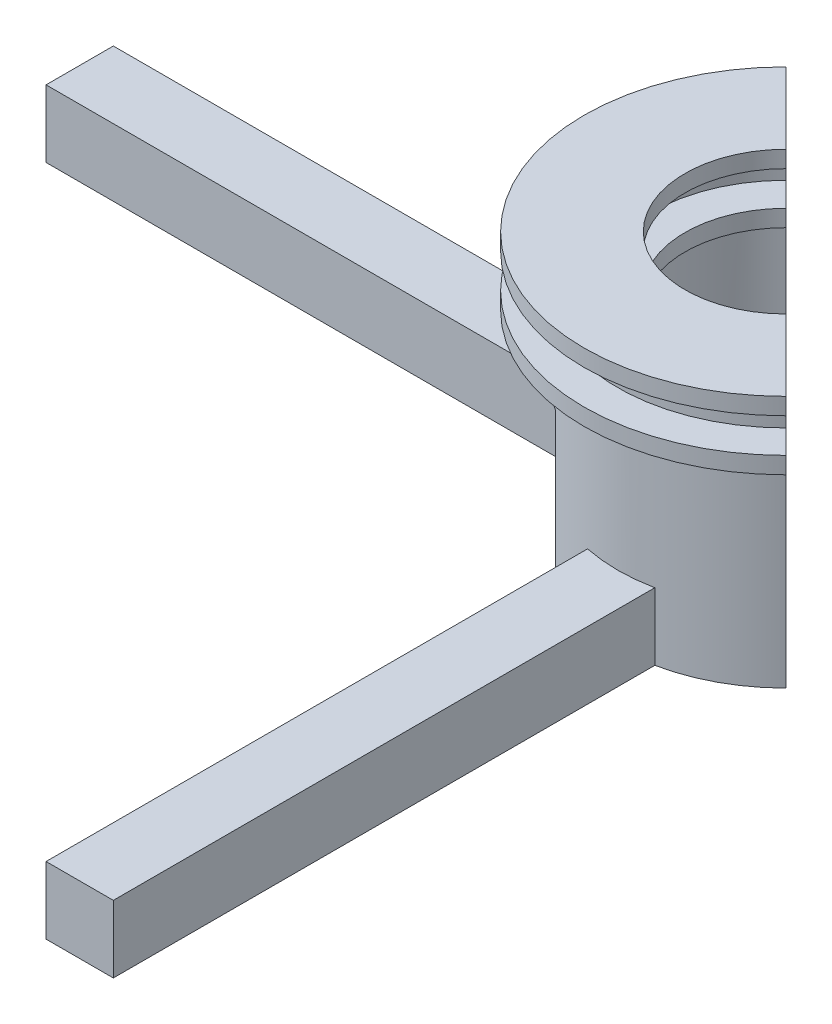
ISO-10303-21;
HEADER;
FILE_DESCRIPTION(('STEP AP214'),'2;1');
FILE_NAME('part.step','',(''),(''),'','','');
FILE_SCHEMA(('AUTOMOTIVE_DESIGN { 1 0 10303 214 1 1 1 1 }'));
ENDSEC;
DATA;
#1=APPLICATION_CONTEXT('core data for automotive mechanical design processes');
#2=APPLICATION_PROTOCOL_DEFINITION('international standard','automotive_design',2000,#1);
#3=PRODUCT_CONTEXT('',#1,'mechanical');
#4=PRODUCT('Part','Part','',(#3));
#5=PRODUCT_RELATED_PRODUCT_CATEGORY('part','',(#4));
#6=PRODUCT_DEFINITION_FORMATION('','',#4);
#7=PRODUCT_DEFINITION_CONTEXT('part definition',#1,'design');
#8=PRODUCT_DEFINITION('design','',#6,#7);
#9=PRODUCT_DEFINITION_SHAPE('','',#8);
#10=(LENGTH_UNIT() NAMED_UNIT(*) SI_UNIT(.MILLI.,.METRE.));
#11=(NAMED_UNIT(*) PLANE_ANGLE_UNIT() SI_UNIT($,.RADIAN.));
#12=(NAMED_UNIT(*) SI_UNIT($,.STERADIAN.) SOLID_ANGLE_UNIT());
#13=UNCERTAINTY_MEASURE_WITH_UNIT(LENGTH_MEASURE(1.E-05),#10,'distance_accuracy_value','');
#14=(GEOMETRIC_REPRESENTATION_CONTEXT(3) GLOBAL_UNCERTAINTY_ASSIGNED_CONTEXT((#13)) GLOBAL_UNIT_ASSIGNED_CONTEXT((#10,
#11,#12)) REPRESENTATION_CONTEXT('',''));
#15=CARTESIAN_POINT('',(0.,0.,0.));
#16=DIRECTION('',(0.,0.,1.));
#17=DIRECTION('',(1.,0.,0.));
#18=AXIS2_PLACEMENT_3D('',#15,#16,#17);
#19=CARTESIAN_POINT('',(0.,-41.1,0.));
#20=DIRECTION('',(0.,1.,0.));
#21=DIRECTION('',(0.,0.,1.));
#22=AXIS2_PLACEMENT_3D('',#19,#20,#21);
#23=PLANE('',#22);
#24=CARTESIAN_POINT('',(0.,-41.1,0.));
#25=DIRECTION('',(0.,1.,0.));
#26=DIRECTION('',(0.,0.,1.));
#27=AXIS2_PLACEMENT_3D('',#24,#25,#26);
#28=CIRCLE('',#27,25.);
#29=CARTESIAN_POINT('',(-17.6776695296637,-41.1,-17.6776695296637));
#30=VERTEX_POINT('',#29);
#31=CARTESIAN_POINT('',(-24.4948974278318,-41.1,-4.99999999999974));
#32=VERTEX_POINT('',#31);
#33=EDGE_CURVE('E276',#30,#32,#28,.T.);
#34=ORIENTED_EDGE('',*,*,#33,.F.);
#35=DIRECTION('',(0.707106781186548,0.,0.707106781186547));
#36=VECTOR('',#35,1.);
#37=CARTESIAN_POINT('',(0.,-41.1,0.));
#38=LINE('',#37,#36);
#39=CARTESIAN_POINT('',(-4.34870670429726,-41.1,-4.34870670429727));
#40=VERTEX_POINT('',#39);
#41=EDGE_CURVE('E265',#30,#40,#38,.T.);
#42=ORIENTED_EDGE('',*,*,#41,.T.);
#43=DIRECTION('',(0.707106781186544,0.,-0.707106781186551));
#44=VECTOR('',#43,1.);
#45=CARTESIAN_POINT('',(-17.8056287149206,-41.1,9.1082153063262));
#46=LINE('',#45,#44);
#47=CARTESIAN_POINT('',(-9.65200756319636,-41.1,0.95459415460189));
#48=VERTEX_POINT('',#47);
#49=EDGE_CURVE('E273',#48,#40,#46,.T.);
#50=ORIENTED_EDGE('',*,*,#49,.F.);
#51=DIRECTION('',(0.707106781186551,0.,0.707106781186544));
#52=VECTOR('',#51,1.);
#53=CARTESIAN_POINT('',(-20.050749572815,-41.1,-9.44414785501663));
#54=LINE('',#53,#52);
#55=CARTESIAN_POINT('',(-18.413411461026,-41.1,-7.80680974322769));
#56=VERTEX_POINT('',#55);
#57=EDGE_CURVE('E305',#56,#48,#54,.T.);
#58=ORIENTED_EDGE('',*,*,#57,.F.);
#59=CARTESIAN_POINT('',(0.,-41.1,0.));
#60=DIRECTION('',(0.,1.,0.));
#61=DIRECTION('',(0.,0.,1.));
#62=AXIS2_PLACEMENT_3D('',#59,#60,#61);
#63=CIRCLE('',#62,20.);
#64=CARTESIAN_POINT('',(-17.8056287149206,-41.1,9.1082153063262));
#65=VERTEX_POINT('',#64);
#66=EDGE_CURVE('E477',#56,#65,#63,.T.);
#67=ORIENTED_EDGE('',*,*,#66,.T.);
#68=DIRECTION('',(-0.707106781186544,0.,0.707106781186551));
#69=VECTOR('',#68,1.);
#70=CARTESIAN_POINT('',(100.651293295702,-41.1,-109.348706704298));
#71=LINE('',#70,#69);
#72=CARTESIAN_POINT('',(-21.4831384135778,-41.1,12.7857250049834));
#73=VERTEX_POINT('',#72);
#74=EDGE_CURVE('E309',#65,#73,#71,.T.);
#75=ORIENTED_EDGE('',*,*,#74,.T.);
#76=CARTESIAN_POINT('',(-24.4948974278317,-41.1,5.00000000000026));
#77=VERTEX_POINT('',#76);
#78=EDGE_CURVE('E417',#77,#73,#28,.T.);
#79=ORIENTED_EDGE('',*,*,#78,.F.);
#80=DIRECTION('',(1.,0.,0.));
#81=VECTOR('',#80,1.);
#82=CARTESIAN_POINT('',(-105.,-41.1,5.0000000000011));
#83=LINE('',#82,#81);
#84=CARTESIAN_POINT('',(-105.,-41.1,5.0000000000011));
#85=VERTEX_POINT('',#84);
#86=EDGE_CURVE('E367',#85,#77,#83,.T.);
#87=ORIENTED_EDGE('',*,*,#86,.F.);
#88=DIRECTION('',(0.,0.,1.));
#89=VECTOR('',#88,1.);
#90=CARTESIAN_POINT('',(-105.,-41.1,5.0000000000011));
#91=LINE('',#90,#89);
#92=CARTESIAN_POINT('',(-105.,-41.1,-4.9999999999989));
#93=VERTEX_POINT('',#92);
#94=EDGE_CURVE('E339',#93,#85,#91,.T.);
#95=ORIENTED_EDGE('',*,*,#94,.F.);
#96=DIRECTION('',(1.,0.,0.));
#97=VECTOR('',#96,1.);
#98=CARTESIAN_POINT('',(-105.,-41.1,-4.9999999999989));
#99=LINE('',#98,#97);
#100=EDGE_CURVE('E356',#93,#32,#99,.T.);
#101=ORIENTED_EDGE('',*,*,#100,.T.);
#102=EDGE_LOOP('',(#34,#42,#50,#58,#67,#75,#79,#87,#95,#101));
#103=FACE_BOUND('',#102,.T.);
#104=ADVANCED_FACE('F45',(#103),#23,.F.);
#105=CARTESIAN_POINT('',(-20.050749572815,-26.1,-9.44414785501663));
#106=DIRECTION('',(0.,-1.,0.));
#107=DIRECTION('',(0.,0.,-1.));
#108=AXIS2_PLACEMENT_3D('',#105,#106,#107);
#109=PLANE('',#108);
#110=DIRECTION('',(0.707106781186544,0.,-0.707106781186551));
#111=VECTOR('',#110,1.);
#112=CARTESIAN_POINT('',(-9.65200756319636,-26.1,0.95459415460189));
#113=LINE('',#112,#111);
#114=CARTESIAN_POINT('',(-9.65200756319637,-26.1,0.954594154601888));
#115=VERTEX_POINT('',#114);
#116=CARTESIAN_POINT('',(-4.34870670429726,-26.1,-4.34870670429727));
#117=VERTEX_POINT('',#116);
#118=EDGE_CURVE('E296',#115,#117,#113,.T.);
#119=ORIENTED_EDGE('',*,*,#118,.T.);
#120=DIRECTION('',(-0.707106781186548,0.,-0.707106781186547));
#121=VECTOR('',#120,1.);
#122=CARTESIAN_POINT('',(-14.7474487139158,-26.1,-14.7474487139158));
#123=LINE('',#122,#121);
#124=CARTESIAN_POINT('',(-14.142135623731,-26.1,-14.142135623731));
#125=VERTEX_POINT('',#124);
#126=EDGE_CURVE('E69',#117,#125,#123,.T.);
#127=ORIENTED_EDGE('',*,*,#126,.T.);
#128=CARTESIAN_POINT('',(0.,-26.1,0.));
#129=DIRECTION('',(0.,-1.,0.));
#130=DIRECTION('',(0.,0.,-1.));
#131=AXIS2_PLACEMENT_3D('',#128,#129,#130);
#132=CIRCLE('',#131,20.);
#133=CARTESIAN_POINT('',(-18.413411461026,-26.1,-7.80680974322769));
#134=VERTEX_POINT('',#133);
#135=EDGE_CURVE('E490',#125,#134,#132,.F.);
#136=ORIENTED_EDGE('',*,*,#135,.T.);
#137=DIRECTION('',(0.707106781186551,0.,0.707106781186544));
#138=VECTOR('',#137,1.);
#139=CARTESIAN_POINT('',(-20.050749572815,-26.1,-9.44414785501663));
#140=LINE('',#139,#138);
#141=EDGE_CURVE('E300',#134,#115,#140,.T.);
#142=ORIENTED_EDGE('',*,*,#141,.T.);
#143=EDGE_LOOP('',(#119,#127,#136,#142));
#144=FACE_BOUND('',#143,.T.);
#145=ADVANCED_FACE('F511',(#144),#109,.F.);
#146=CARTESIAN_POINT('',(-20.050749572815,-41.1,-9.44414785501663));
#147=DIRECTION('',(0.707106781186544,0.,-0.707106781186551));
#148=DIRECTION('',(-0.707106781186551,0.,-0.707106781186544));
#149=AXIS2_PLACEMENT_3D('',#146,#147,#148);
#150=PLANE('',#149);
#151=ORIENTED_EDGE('',*,*,#57,.T.);
#152=DIRECTION('',(0.,1.,0.));
#153=VECTOR('',#152,1.);
#154=CARTESIAN_POINT('',(-9.65200756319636,-41.1,0.954594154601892));
#155=LINE('',#154,#153);
#156=EDGE_CURVE('E54',#48,#115,#155,.T.);
#157=ORIENTED_EDGE('',*,*,#156,.T.);
#158=ORIENTED_EDGE('',*,*,#141,.F.);
#159=DIRECTION('',(0.,1.,0.));
#160=VECTOR('',#159,1.);
#161=CARTESIAN_POINT('',(-18.413411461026,0.,-7.80680974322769));
#162=LINE('',#161,#160);
#163=EDGE_CURVE('E493',#134,#56,#162,.F.);
#164=ORIENTED_EDGE('',*,*,#163,.T.);
#165=EDGE_LOOP('',(#151,#157,#158,#164));
#166=FACE_BOUND('',#165,.T.);
#167=ADVANCED_FACE('F508',(#166),#150,.F.);
#168=DIRECTION('',(-0.707106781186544,0.,0.707106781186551));
#169=VECTOR('',#168,1.);
#170=CARTESIAN_POINT('',(17.8056287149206,-41.1,-9.1082153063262));
#171=LINE('',#170,#169);
#172=CARTESIAN_POINT('',(4.34870670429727,-41.1,4.34870670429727));
#173=VERTEX_POINT('',#172);
#174=CARTESIAN_POINT('',(-0.954594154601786,-41.1,9.65200756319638));
#175=VERTEX_POINT('',#174);
#176=EDGE_CURVE('E283',#173,#175,#171,.T.);
#177=ORIENTED_EDGE('',*,*,#176,.F.);
#178=DIRECTION('',(0.707106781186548,0.,0.707106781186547));
#179=VECTOR('',#178,1.);
#180=CARTESIAN_POINT('',(0.,-41.1,0.));
#181=LINE('',#180,#179);
#182=CARTESIAN_POINT('',(17.6776695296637,-41.1,17.6776695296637));
#183=VERTEX_POINT('',#182);
#184=EDGE_CURVE('E61',#173,#183,#181,.T.);
#185=ORIENTED_EDGE('',*,*,#184,.T.);
#186=CARTESIAN_POINT('',(5.,-41.1,24.4948974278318));
#187=VERTEX_POINT('',#186);
#188=EDGE_CURVE('E412',#187,#183,#28,.T.);
#189=ORIENTED_EDGE('',*,*,#188,.F.);
#190=DIRECTION('',(0.,0.,-1.));
#191=VECTOR('',#190,1.);
#192=CARTESIAN_POINT('',(5.,-41.1,105.));
#193=LINE('',#192,#191);
#194=CARTESIAN_POINT('',(5.,-41.1,105.));
#195=VERTEX_POINT('',#194);
#196=EDGE_CURVE('E407',#195,#187,#193,.T.);
#197=ORIENTED_EDGE('',*,*,#196,.F.);
#198=DIRECTION('',(1.,0.,0.));
#199=VECTOR('',#198,1.);
#200=CARTESIAN_POINT('',(5.,-41.1,105.));
#201=LINE('',#200,#199);
#202=CARTESIAN_POINT('',(-5.,-41.1,105.));
#203=VERTEX_POINT('',#202);
#204=EDGE_CURVE('E378',#203,#195,#201,.T.);
#205=ORIENTED_EDGE('',*,*,#204,.F.);
#206=DIRECTION('',(0.,0.,-1.));
#207=VECTOR('',#206,1.);
#208=CARTESIAN_POINT('',(-5.,-41.1,105.));
#209=LINE('',#208,#207);
#210=CARTESIAN_POINT('',(-5.,-41.1,24.4948974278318));
#211=VERTEX_POINT('',#210);
#212=EDGE_CURVE('E395',#203,#211,#209,.T.);
#213=ORIENTED_EDGE('',*,*,#212,.T.);
#214=CARTESIAN_POINT('',(-12.7857250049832,-41.1,21.4831384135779));
#215=VERTEX_POINT('',#214);
#216=EDGE_CURVE('E411',#215,#211,#28,.T.);
#217=ORIENTED_EDGE('',*,*,#216,.F.);
#218=DIRECTION('',(-0.707106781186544,0.,0.707106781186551));
#219=VECTOR('',#218,1.);
#220=CARTESIAN_POINT('',(109.348706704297,-41.1,-100.651293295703));
#221=LINE('',#220,#219);
#222=CARTESIAN_POINT('',(-9.10821530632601,-41.1,17.8056287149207));
#223=VERTEX_POINT('',#222);
#224=EDGE_CURVE('E308',#223,#215,#221,.T.);
#225=ORIENTED_EDGE('',*,*,#224,.F.);
#226=CARTESIAN_POINT('',(7.80680974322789,-41.1,18.413411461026));
#227=VERTEX_POINT('',#226);
#228=EDGE_CURVE('E473',#223,#227,#63,.T.);
#229=ORIENTED_EDGE('',*,*,#228,.T.);
#230=EDGE_CURVE('E304',#175,#227,#54,.T.);
#231=ORIENTED_EDGE('',*,*,#230,.F.);
#232=EDGE_LOOP('',(#177,#185,#189,#197,#205,#213,#217,#225,#229,#231));
#233=FACE_BOUND('',#232,.T.);
#234=ADVANCED_FACE('F47',(#233),#23,.F.);
#235=CARTESIAN_POINT('',(0.,0.,0.));
#236=DIRECTION('',(0.,1.,0.));
#237=DIRECTION('',(0.,0.,1.));
#238=AXIS2_PLACEMENT_3D('',#235,#236,#237);
#239=CYLINDRICAL_SURFACE('',#238,25.);
#240=DIRECTION('',(0.,1.,0.));
#241=VECTOR('',#240,1.);
#242=CARTESIAN_POINT('',(17.6776695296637,0.,17.6776695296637));
#243=LINE('',#242,#241);
#244=CARTESIAN_POINT('',(17.6776695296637,-10.1,17.6776695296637));
#245=VERTEX_POINT('',#244);
#246=EDGE_CURVE('E554',#245,#183,#243,.F.);
#247=ORIENTED_EDGE('',*,*,#246,.F.);
#248=CARTESIAN_POINT('',(0.,-10.1,0.));
#249=DIRECTION('',(0.,1.,0.));
#250=DIRECTION('',(0.,0.,1.));
#251=AXIS2_PLACEMENT_3D('',#248,#249,#250);
#252=CIRCLE('',#251,25.);
#253=CARTESIAN_POINT('',(-17.6776695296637,-10.1,-17.6776695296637));
#254=VERTEX_POINT('',#253);
#255=EDGE_CURVE('E416',#254,#245,#252,.T.);
#256=ORIENTED_EDGE('',*,*,#255,.F.);
#257=DIRECTION('',(0.,1.,0.));
#258=VECTOR('',#257,1.);
#259=CARTESIAN_POINT('',(-17.6776695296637,0.,-17.6776695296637));
#260=LINE('',#259,#258);
#261=EDGE_CURVE('E625',#30,#254,#260,.T.);
#262=ORIENTED_EDGE('',*,*,#261,.F.);
#263=ORIENTED_EDGE('',*,*,#33,.T.);
#264=DIRECTION('',(0.,1.,0.));
#265=VECTOR('',#264,1.);
#266=CARTESIAN_POINT('',(-24.4948974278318,0.,-4.99999999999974));
#267=LINE('',#266,#265);
#268=CARTESIAN_POINT('',(-24.4948974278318,-31.1,-4.99999999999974));
#269=VERTEX_POINT('',#268);
#270=EDGE_CURVE('E332',#32,#269,#267,.T.);
#271=ORIENTED_EDGE('',*,*,#270,.T.);
#272=CARTESIAN_POINT('',(0.,-31.1,0.));
#273=DIRECTION('',(0.,1.,0.));
#274=DIRECTION('',(0.,0.,1.));
#275=AXIS2_PLACEMENT_3D('',#272,#273,#274);
#276=CIRCLE('',#275,25.);
#277=CARTESIAN_POINT('',(-24.4948974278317,-31.1,5.00000000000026));
#278=VERTEX_POINT('',#277);
#279=EDGE_CURVE('E336',#269,#278,#276,.T.);
#280=ORIENTED_EDGE('',*,*,#279,.T.);
#281=DIRECTION('',(0.,1.,0.));
#282=VECTOR('',#281,1.);
#283=CARTESIAN_POINT('',(-24.4948974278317,0.,5.00000000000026));
#284=LINE('',#283,#282);
#285=EDGE_CURVE('E335',#278,#77,#284,.F.);
#286=ORIENTED_EDGE('',*,*,#285,.T.);
#287=ORIENTED_EDGE('',*,*,#78,.T.);
#288=DIRECTION('',(0.,1.,0.));
#289=VECTOR('',#288,1.);
#290=CARTESIAN_POINT('',(-21.4831384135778,0.,12.7857250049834));
#291=LINE('',#290,#289);
#292=CARTESIAN_POINT('',(-21.4831384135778,-18.6,12.7857250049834));
#293=VERTEX_POINT('',#292);
#294=EDGE_CURVE('E329',#293,#73,#291,.F.);
#295=ORIENTED_EDGE('',*,*,#294,.F.);
#296=CARTESIAN_POINT('',(0.,-18.6,0.));
#297=DIRECTION('',(0.,1.,0.));
#298=DIRECTION('',(0.,0.,1.));
#299=AXIS2_PLACEMENT_3D('',#296,#297,#298);
#300=CIRCLE('',#299,25.);
#301=CARTESIAN_POINT('',(-12.7857250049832,-18.6,21.4831384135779));
#302=VERTEX_POINT('',#301);
#303=EDGE_CURVE('E326',#302,#293,#300,.F.);
#304=ORIENTED_EDGE('',*,*,#303,.F.);
#305=DIRECTION('',(0.,1.,0.));
#306=VECTOR('',#305,1.);
#307=CARTESIAN_POINT('',(-12.7857250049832,0.,21.4831384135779));
#308=LINE('',#307,#306);
#309=EDGE_CURVE('E313',#215,#302,#308,.T.);
#310=ORIENTED_EDGE('',*,*,#309,.F.);
#311=ORIENTED_EDGE('',*,*,#216,.T.);
#312=DIRECTION('',(0.,1.,0.));
#313=VECTOR('',#312,1.);
#314=CARTESIAN_POINT('',(-4.99999999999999,0.,24.4948974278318));
#315=LINE('',#314,#313);
#316=CARTESIAN_POINT('',(-4.99999999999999,-31.1,24.4948974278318));
#317=VERTEX_POINT('',#316);
#318=EDGE_CURVE('E371',#211,#317,#315,.T.);
#319=ORIENTED_EDGE('',*,*,#318,.T.);
#320=CARTESIAN_POINT('',(0.,-31.1,0.));
#321=DIRECTION('',(0.,1.,0.));
#322=DIRECTION('',(0.,0.,1.));
#323=AXIS2_PLACEMENT_3D('',#320,#321,#322);
#324=CIRCLE('',#323,25.);
#325=CARTESIAN_POINT('',(5.,-31.1,24.4948974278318));
#326=VERTEX_POINT('',#325);
#327=EDGE_CURVE('E375',#317,#326,#324,.T.);
#328=ORIENTED_EDGE('',*,*,#327,.T.);
#329=DIRECTION('',(0.,1.,0.));
#330=VECTOR('',#329,1.);
#331=CARTESIAN_POINT('',(5.,0.,24.4948974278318));
#332=LINE('',#331,#330);
#333=EDGE_CURVE('E374',#326,#187,#332,.F.);
#334=ORIENTED_EDGE('',*,*,#333,.T.);
#335=ORIENTED_EDGE('',*,*,#188,.T.);
#336=EDGE_LOOP('',(#247,#256,#262,#263,#271,#280,#286,#287,#295,#304,#310,#311,#319,#328,#334,#335));
#337=FACE_BOUND('',#336,.T.);
#338=ADVANCED_FACE('F640',(#337),#239,.T.);
#339=CARTESIAN_POINT('',(0.,0.,0.));
#340=DIRECTION('',(0.,1.,0.));
#341=DIRECTION('',(0.,0.,1.));
#342=AXIS2_PLACEMENT_3D('',#339,#340,#341);
#343=CYLINDRICAL_SURFACE('',#342,20.);
#344=CARTESIAN_POINT('',(0.,-10.1,0.));
#345=DIRECTION('',(0.,1.,0.));
#346=DIRECTION('',(0.,0.,1.));
#347=AXIS2_PLACEMENT_3D('',#344,#345,#346);
#348=CIRCLE('',#347,20.);
#349=CARTESIAN_POINT('',(-14.1421356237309,-10.1,-14.142135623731));
#350=VERTEX_POINT('',#349);
#351=CARTESIAN_POINT('',(14.142135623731,-10.1,14.1421356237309));
#352=VERTEX_POINT('',#351);
#353=EDGE_CURVE('E469',#350,#352,#348,.T.);
#354=ORIENTED_EDGE('',*,*,#353,.T.);
#355=DIRECTION('',(0.,1.,0.));
#356=VECTOR('',#355,1.);
#357=CARTESIAN_POINT('',(14.142135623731,0.,14.1421356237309));
#358=LINE('',#357,#356);
#359=CARTESIAN_POINT('',(14.142135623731,-26.1,14.1421356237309));
#360=VERTEX_POINT('',#359);
#361=EDGE_CURVE('E540',#352,#360,#358,.F.);
#362=ORIENTED_EDGE('',*,*,#361,.T.);
#363=CARTESIAN_POINT('',(7.80680974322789,-26.1,18.413411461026));
#364=VERTEX_POINT('',#363);
#365=EDGE_CURVE('E494',#364,#360,#132,.F.);
#366=ORIENTED_EDGE('',*,*,#365,.F.);
#367=DIRECTION('',(0.,1.,0.));
#368=VECTOR('',#367,1.);
#369=CARTESIAN_POINT('',(7.80680974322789,0.,18.413411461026));
#370=LINE('',#369,#368);
#371=EDGE_CURVE('E498',#227,#364,#370,.T.);
#372=ORIENTED_EDGE('',*,*,#371,.F.);
#373=ORIENTED_EDGE('',*,*,#228,.F.);
#374=DIRECTION('',(0.,1.,0.));
#375=VECTOR('',#374,1.);
#376=CARTESIAN_POINT('',(-9.10821530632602,0.,17.8056287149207));
#377=LINE('',#376,#375);
#378=CARTESIAN_POINT('',(-9.10821530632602,-18.6,17.8056287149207));
#379=VERTEX_POINT('',#378);
#380=EDGE_CURVE('E478',#223,#379,#377,.T.);
#381=ORIENTED_EDGE('',*,*,#380,.T.);
#382=CARTESIAN_POINT('',(0.,-18.6,0.));
#383=DIRECTION('',(0.,1.,0.));
#384=DIRECTION('',(0.,0.,1.));
#385=AXIS2_PLACEMENT_3D('',#382,#383,#384);
#386=CIRCLE('',#385,20.);
#387=CARTESIAN_POINT('',(-17.8056287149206,-18.6,9.1082153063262));
#388=VERTEX_POINT('',#387);
#389=EDGE_CURVE('E482',#379,#388,#386,.F.);
#390=ORIENTED_EDGE('',*,*,#389,.T.);
#391=DIRECTION('',(0.,1.,0.));
#392=VECTOR('',#391,1.);
#393=CARTESIAN_POINT('',(-17.8056287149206,0.,9.1082153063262));
#394=LINE('',#393,#392);
#395=EDGE_CURVE('E486',#388,#65,#394,.F.);
#396=ORIENTED_EDGE('',*,*,#395,.T.);
#397=ORIENTED_EDGE('',*,*,#66,.F.);
#398=ORIENTED_EDGE('',*,*,#163,.F.);
#399=ORIENTED_EDGE('',*,*,#135,.F.);
#400=DIRECTION('',(0.,1.,0.));
#401=VECTOR('',#400,1.);
#402=CARTESIAN_POINT('',(-14.1421356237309,0.,-14.142135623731));
#403=LINE('',#402,#401);
#404=EDGE_CURVE('E278',#125,#350,#403,.T.);
#405=ORIENTED_EDGE('',*,*,#404,.T.);
#406=EDGE_LOOP('',(#354,#362,#366,#372,#373,#381,#390,#396,#397,#398,#399,#405));
#407=FACE_BOUND('',#406,.T.);
#408=ADVANCED_FACE('F515',(#407),#343,.F.);
#409=CARTESIAN_POINT('',(0.,-10.1,0.));
#410=DIRECTION('',(0.,1.,0.));
#411=DIRECTION('',(0.,0.,1.));
#412=AXIS2_PLACEMENT_3D('',#409,#410,#411);
#413=PLANE('',#412);
#414=ORIENTED_EDGE('',*,*,#353,.F.);
#415=DIRECTION('',(0.707106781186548,0.,0.707106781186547));
#416=VECTOR('',#415,1.);
#417=CARTESIAN_POINT('',(0.,-10.1,0.));
#418=LINE('',#417,#416);
#419=CARTESIAN_POINT('',(-10.6066017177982,-10.1,-10.6066017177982));
#420=VERTEX_POINT('',#419);
#421=EDGE_CURVE('E648',#350,#420,#418,.T.);
#422=ORIENTED_EDGE('',*,*,#421,.T.);
#423=CARTESIAN_POINT('',(0.,-10.1,0.));
#424=DIRECTION('',(0.,1.,0.));
#425=DIRECTION('',(0.,0.,1.));
#426=AXIS2_PLACEMENT_3D('',#423,#424,#425);
#427=CIRCLE('',#426,15.);
#428=CARTESIAN_POINT('',(10.6066017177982,-10.1,10.6066017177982));
#429=VERTEX_POINT('',#428);
#430=EDGE_CURVE('E465',#420,#429,#427,.T.);
#431=ORIENTED_EDGE('',*,*,#430,.T.);
#432=EDGE_CURVE('E548',#429,#352,#418,.T.);
#433=ORIENTED_EDGE('',*,*,#432,.T.);
#434=EDGE_LOOP('',(#414,#422,#431,#433));
#435=FACE_BOUND('',#434,.T.);
#436=ADVANCED_FACE('F840',(#435),#413,.F.);
#437=CARTESIAN_POINT('',(0.,0.,0.));
#438=DIRECTION('',(0.,1.,0.));
#439=DIRECTION('',(0.,0.,1.));
#440=AXIS2_PLACEMENT_3D('',#437,#438,#439);
#441=CYLINDRICAL_SURFACE('',#440,15.);
#442=CARTESIAN_POINT('',(0.,-7.6,0.));
#443=DIRECTION('',(0.,1.,0.));
#444=DIRECTION('',(0.,0.,1.));
#445=AXIS2_PLACEMENT_3D('',#442,#443,#444);
#446=CIRCLE('',#445,15.);
#447=CARTESIAN_POINT('',(-10.6066017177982,-7.6,-10.6066017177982));
#448=VERTEX_POINT('',#447);
#449=CARTESIAN_POINT('',(10.6066017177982,-7.6,10.6066017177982));
#450=VERTEX_POINT('',#449);
#451=EDGE_CURVE('E461',#448,#450,#446,.T.);
#452=ORIENTED_EDGE('',*,*,#451,.T.);
#453=DIRECTION('',(0.,1.,0.));
#454=VECTOR('',#453,1.);
#455=CARTESIAN_POINT('',(10.6066017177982,0.,10.6066017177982));
#456=LINE('',#455,#454);
#457=EDGE_CURVE('E284',#450,#429,#456,.F.);
#458=ORIENTED_EDGE('',*,*,#457,.T.);
#459=ORIENTED_EDGE('',*,*,#430,.F.);
#460=DIRECTION('',(0.,1.,0.));
#461=VECTOR('',#460,1.);
#462=CARTESIAN_POINT('',(-10.6066017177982,0.,-10.6066017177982));
#463=LINE('',#462,#461);
#464=EDGE_CURVE('E651',#420,#448,#463,.T.);
#465=ORIENTED_EDGE('',*,*,#464,.T.);
#466=EDGE_LOOP('',(#452,#458,#459,#465));
#467=FACE_BOUND('',#466,.T.);
#468=ADVANCED_FACE('F830',(#467),#441,.F.);
#469=CARTESIAN_POINT('',(0.,-7.6,0.));
#470=DIRECTION('',(0.,-1.,0.));
#471=DIRECTION('',(0.,0.,-1.));
#472=AXIS2_PLACEMENT_3D('',#469,#470,#471);
#473=PLANE('',#472);
#474=CARTESIAN_POINT('',(0.,-7.6,0.));
#475=DIRECTION('',(0.,1.,0.));
#476=DIRECTION('',(0.,0.,1.));
#477=AXIS2_PLACEMENT_3D('',#474,#475,#476);
#478=CIRCLE('',#477,20.1);
#479=CARTESIAN_POINT('',(-14.2128463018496,-7.6,-14.2128463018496));
#480=VERTEX_POINT('',#479);
#481=CARTESIAN_POINT('',(14.2128463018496,-7.6,14.2128463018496));
#482=VERTEX_POINT('',#481);
#483=EDGE_CURVE('E457',#480,#482,#478,.T.);
#484=ORIENTED_EDGE('',*,*,#483,.T.);
#485=DIRECTION('',(-0.707106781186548,0.,-0.707106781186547));
#486=VECTOR('',#485,1.);
#487=CARTESIAN_POINT('',(0.,-7.6,0.));
#488=LINE('',#487,#486);
#489=EDGE_CURVE('E291',#482,#450,#488,.T.);
#490=ORIENTED_EDGE('',*,*,#489,.T.);
#491=ORIENTED_EDGE('',*,*,#451,.F.);
#492=EDGE_CURVE('E584',#448,#480,#488,.T.);
#493=ORIENTED_EDGE('',*,*,#492,.T.);
#494=EDGE_LOOP('',(#484,#490,#491,#493));
#495=FACE_BOUND('',#494,.T.);
#496=ADVANCED_FACE('F660',(#495),#473,.F.);
#497=CARTESIAN_POINT('',(0.,0.,0.));
#498=DIRECTION('',(0.,1.,0.));
#499=DIRECTION('',(0.,0.,1.));
#500=AXIS2_PLACEMENT_3D('',#497,#498,#499);
#501=CYLINDRICAL_SURFACE('',#500,20.1);
#502=CARTESIAN_POINT('',(0.,-2.5,0.));
#503=DIRECTION('',(0.,1.,0.));
#504=DIRECTION('',(0.,0.,1.));
#505=AXIS2_PLACEMENT_3D('',#502,#503,#504);
#506=CIRCLE('',#505,20.1);
#507=CARTESIAN_POINT('',(-14.2128463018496,-2.5,-14.2128463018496));
#508=VERTEX_POINT('',#507);
#509=CARTESIAN_POINT('',(14.2128463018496,-2.5,14.2128463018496));
#510=VERTEX_POINT('',#509);
#511=EDGE_CURVE('E453',#508,#510,#506,.T.);
#512=ORIENTED_EDGE('',*,*,#511,.T.);
#513=DIRECTION('',(0.,1.,0.));
#514=VECTOR('',#513,1.);
#515=CARTESIAN_POINT('',(14.2128463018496,0.,14.2128463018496));
#516=LINE('',#515,#514);
#517=EDGE_CURVE('E575',#510,#482,#516,.F.);
#518=ORIENTED_EDGE('',*,*,#517,.T.);
#519=ORIENTED_EDGE('',*,*,#483,.F.);
#520=DIRECTION('',(0.,1.,0.));
#521=VECTOR('',#520,1.);
#522=CARTESIAN_POINT('',(-14.2128463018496,0.,-14.2128463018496));
#523=LINE('',#522,#521);
#524=EDGE_CURVE('E594',#480,#508,#523,.T.);
#525=ORIENTED_EDGE('',*,*,#524,.T.);
#526=EDGE_LOOP('',(#512,#518,#519,#525));
#527=FACE_BOUND('',#526,.T.);
#528=ADVANCED_FACE('F661',(#527),#501,.F.);
#529=CARTESIAN_POINT('',(0.,-2.5,0.));
#530=DIRECTION('',(0.,1.,0.));
#531=DIRECTION('',(0.,0.,1.));
#532=AXIS2_PLACEMENT_3D('',#529,#530,#531);
#533=PLANE('',#532);
#534=ORIENTED_EDGE('',*,*,#511,.F.);
#535=DIRECTION('',(0.707106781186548,0.,0.707106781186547));
#536=VECTOR('',#535,1.);
#537=CARTESIAN_POINT('',(0.,-2.5,0.));
#538=LINE('',#537,#536);
#539=CARTESIAN_POINT('',(-10.6066017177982,-2.5,-10.6066017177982));
#540=VERTEX_POINT('',#539);
#541=EDGE_CURVE('E587',#508,#540,#538,.T.);
#542=ORIENTED_EDGE('',*,*,#541,.T.);
#543=CARTESIAN_POINT('',(0.,-2.5,0.));
#544=DIRECTION('',(0.,1.,0.));
#545=DIRECTION('',(0.,0.,1.));
#546=AXIS2_PLACEMENT_3D('',#543,#544,#545);
#547=CIRCLE('',#546,15.);
#548=CARTESIAN_POINT('',(10.6066017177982,-2.5,10.6066017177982));
#549=VERTEX_POINT('',#548);
#550=EDGE_CURVE('E449',#540,#549,#547,.T.);
#551=ORIENTED_EDGE('',*,*,#550,.T.);
#552=EDGE_CURVE('E574',#549,#510,#538,.T.);
#553=ORIENTED_EDGE('',*,*,#552,.T.);
#554=EDGE_LOOP('',(#534,#542,#551,#553));
#555=FACE_BOUND('',#554,.T.);
#556=ADVANCED_FACE('F662',(#555),#533,.F.);
#557=CARTESIAN_POINT('',(0.,0.,0.));
#558=DIRECTION('',(0.,1.,0.));
#559=DIRECTION('',(0.,0.,1.));
#560=AXIS2_PLACEMENT_3D('',#557,#558,#559);
#561=CYLINDRICAL_SURFACE('',#560,15.);
#562=CARTESIAN_POINT('',(0.,0.,0.));
#563=DIRECTION('',(0.,1.,0.));
#564=DIRECTION('',(0.,0.,1.));
#565=AXIS2_PLACEMENT_3D('',#562,#563,#564);
#566=CIRCLE('',#565,15.);
#567=CARTESIAN_POINT('',(-10.6066017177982,0.,-10.6066017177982));
#568=VERTEX_POINT('',#567);
#569=CARTESIAN_POINT('',(10.6066017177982,0.,10.6066017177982));
#570=VERTEX_POINT('',#569);
#571=EDGE_CURVE('E445',#568,#570,#566,.T.);
#572=ORIENTED_EDGE('',*,*,#571,.T.);
#573=DIRECTION('',(0.,1.,0.));
#574=VECTOR('',#573,1.);
#575=CARTESIAN_POINT('',(10.6066017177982,0.,10.6066017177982));
#576=LINE('',#575,#574);
#577=EDGE_CURVE('E570',#570,#549,#576,.F.);
#578=ORIENTED_EDGE('',*,*,#577,.T.);
#579=ORIENTED_EDGE('',*,*,#550,.F.);
#580=DIRECTION('',(0.,1.,0.));
#581=VECTOR('',#580,1.);
#582=CARTESIAN_POINT('',(-10.6066017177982,0.,-10.6066017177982));
#583=LINE('',#582,#581);
#584=EDGE_CURVE('E595',#540,#568,#583,.T.);
#585=ORIENTED_EDGE('',*,*,#584,.T.);
#586=EDGE_LOOP('',(#572,#578,#579,#585));
#587=FACE_BOUND('',#586,.T.);
#588=ADVANCED_FACE('F664',(#587),#561,.F.);
#589=CARTESIAN_POINT('',(0.,0.,0.));
#590=DIRECTION('',(0.,1.,0.));
#591=DIRECTION('',(0.,0.,1.));
#592=AXIS2_PLACEMENT_3D('',#589,#590,#591);
#593=PLANE('',#592);
#594=DIRECTION('',(0.707106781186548,0.,0.707106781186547));
#595=VECTOR('',#594,1.);
#596=CARTESIAN_POINT('',(0.,0.,0.));
#597=LINE('',#596,#595);
#598=CARTESIAN_POINT('',(-21.2132034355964,0.,-21.2132034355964));
#599=VERTEX_POINT('',#598);
#600=EDGE_CURVE('E601',#599,#568,#597,.T.);
#601=ORIENTED_EDGE('',*,*,#600,.F.);
#602=CARTESIAN_POINT('',(0.,0.,0.));
#603=DIRECTION('',(0.,1.,0.));
#604=DIRECTION('',(0.,0.,1.));
#605=AXIS2_PLACEMENT_3D('',#602,#603,#604);
#606=CIRCLE('',#605,30.);
#607=CARTESIAN_POINT('',(21.2132034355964,0.,21.2132034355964));
#608=VERTEX_POINT('',#607);
#609=EDGE_CURVE('E441',#599,#608,#606,.T.);
#610=ORIENTED_EDGE('',*,*,#609,.T.);
#611=EDGE_CURVE('E569',#570,#608,#597,.T.);
#612=ORIENTED_EDGE('',*,*,#611,.F.);
#613=ORIENTED_EDGE('',*,*,#571,.F.);
#614=EDGE_LOOP('',(#601,#610,#612,#613));
#615=FACE_BOUND('',#614,.T.);
#616=ADVANCED_FACE('F670',(#615),#593,.T.);
#617=CARTESIAN_POINT('',(0.,0.,0.));
#618=DIRECTION('',(0.,1.,0.));
#619=DIRECTION('',(0.,0.,1.));
#620=AXIS2_PLACEMENT_3D('',#617,#618,#619);
#621=CYLINDRICAL_SURFACE('',#620,30.);
#622=DIRECTION('',(0.,1.,0.));
#623=VECTOR('',#622,1.);
#624=CARTESIAN_POINT('',(21.2132034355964,0.,21.2132034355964));
#625=LINE('',#624,#623);
#626=CARTESIAN_POINT('',(21.2132034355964,-2.5,21.2132034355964));
#627=VERTEX_POINT('',#626);
#628=EDGE_CURVE('E566',#608,#627,#625,.F.);
#629=ORIENTED_EDGE('',*,*,#628,.F.);
#630=ORIENTED_EDGE('',*,*,#609,.F.);
#631=DIRECTION('',(0.,1.,0.));
#632=VECTOR('',#631,1.);
#633=CARTESIAN_POINT('',(-21.2132034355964,0.,-21.2132034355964));
#634=LINE('',#633,#632);
#635=CARTESIAN_POINT('',(-21.2132034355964,-2.5,-21.2132034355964));
#636=VERTEX_POINT('',#635);
#637=EDGE_CURVE('E605',#636,#599,#634,.T.);
#638=ORIENTED_EDGE('',*,*,#637,.F.);
#639=CARTESIAN_POINT('',(0.,-2.5,0.));
#640=DIRECTION('',(0.,1.,0.));
#641=DIRECTION('',(0.,0.,1.));
#642=AXIS2_PLACEMENT_3D('',#639,#640,#641);
#643=CIRCLE('',#642,30.);
#644=EDGE_CURVE('E437',#636,#627,#643,.T.);
#645=ORIENTED_EDGE('',*,*,#644,.T.);
#646=EDGE_LOOP('',(#629,#630,#638,#645));
#647=FACE_BOUND('',#646,.T.);
#648=ADVANCED_FACE('F780',(#647),#621,.T.);
#649=CARTESIAN_POINT('',(0.,-2.5,0.));
#650=DIRECTION('',(0.,-1.,0.));
#651=DIRECTION('',(0.,0.,-1.));
#652=AXIS2_PLACEMENT_3D('',#649,#650,#651);
#653=PLANE('',#652);
#654=DIRECTION('',(-0.707106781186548,0.,-0.707106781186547));
#655=VECTOR('',#654,1.);
#656=CARTESIAN_POINT('',(0.,-2.5,0.));
#657=LINE('',#656,#655);
#658=CARTESIAN_POINT('',(17.6776695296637,-2.5,17.6776695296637));
#659=VERTEX_POINT('',#658);
#660=EDGE_CURVE('E565',#627,#659,#657,.T.);
#661=ORIENTED_EDGE('',*,*,#660,.F.);
#662=ORIENTED_EDGE('',*,*,#644,.F.);
#663=CARTESIAN_POINT('',(-17.6776695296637,-2.5,-17.6776695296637));
#664=VERTEX_POINT('',#663);
#665=EDGE_CURVE('E610',#664,#636,#657,.T.);
#666=ORIENTED_EDGE('',*,*,#665,.F.);
#667=CARTESIAN_POINT('',(0.,-2.5,0.));
#668=DIRECTION('',(0.,1.,0.));
#669=DIRECTION('',(0.,0.,1.));
#670=AXIS2_PLACEMENT_3D('',#667,#668,#669);
#671=CIRCLE('',#670,25.);
#672=EDGE_CURVE('E433',#664,#659,#671,.T.);
#673=ORIENTED_EDGE('',*,*,#672,.T.);
#674=EDGE_LOOP('',(#661,#662,#666,#673));
#675=FACE_BOUND('',#674,.T.);
#676=ADVANCED_FACE('F770',(#675),#653,.T.);
#677=DIRECTION('',(0.,1.,0.));
#678=VECTOR('',#677,1.);
#679=CARTESIAN_POINT('',(17.6776695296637,0.,17.6776695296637));
#680=LINE('',#679,#678);
#681=CARTESIAN_POINT('',(17.6776695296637,-7.6,17.6776695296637));
#682=VERTEX_POINT('',#681);
#683=EDGE_CURVE('E562',#659,#682,#680,.F.);
#684=ORIENTED_EDGE('',*,*,#683,.F.);
#685=ORIENTED_EDGE('',*,*,#672,.F.);
#686=DIRECTION('',(0.,1.,0.));
#687=VECTOR('',#686,1.);
#688=CARTESIAN_POINT('',(-17.6776695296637,0.,-17.6776695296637));
#689=LINE('',#688,#687);
#690=CARTESIAN_POINT('',(-17.6776695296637,-7.6,-17.6776695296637));
#691=VERTEX_POINT('',#690);
#692=EDGE_CURVE('E613',#691,#664,#689,.T.);
#693=ORIENTED_EDGE('',*,*,#692,.F.);
#694=CARTESIAN_POINT('',(0.,-7.6,0.));
#695=DIRECTION('',(0.,1.,0.));
#696=DIRECTION('',(0.,0.,1.));
#697=AXIS2_PLACEMENT_3D('',#694,#695,#696);
#698=CIRCLE('',#697,25.);
#699=EDGE_CURVE('E429',#691,#682,#698,.T.);
#700=ORIENTED_EDGE('',*,*,#699,.T.);
#701=EDGE_LOOP('',(#684,#685,#693,#700));
#702=FACE_BOUND('',#701,.T.);
#703=ADVANCED_FACE('F684',(#702),#239,.T.);
#704=CARTESIAN_POINT('',(0.,-7.6,0.));
#705=DIRECTION('',(0.,1.,0.));
#706=DIRECTION('',(0.,0.,1.));
#707=AXIS2_PLACEMENT_3D('',#704,#705,#706);
#708=PLANE('',#707);
#709=DIRECTION('',(0.707106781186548,0.,0.707106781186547));
#710=VECTOR('',#709,1.);
#711=CARTESIAN_POINT('',(0.,-7.6,0.));
#712=LINE('',#711,#710);
#713=CARTESIAN_POINT('',(-21.2132034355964,-7.6,-21.2132034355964));
#714=VERTEX_POINT('',#713);
#715=EDGE_CURVE('E616',#714,#691,#712,.T.);
#716=ORIENTED_EDGE('',*,*,#715,.F.);
#717=CARTESIAN_POINT('',(0.,-7.6,0.));
#718=DIRECTION('',(0.,1.,0.));
#719=DIRECTION('',(0.,0.,1.));
#720=AXIS2_PLACEMENT_3D('',#717,#718,#719);
#721=CIRCLE('',#720,30.);
#722=CARTESIAN_POINT('',(21.2132034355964,-7.6,21.2132034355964));
#723=VERTEX_POINT('',#722);
#724=EDGE_CURVE('E425',#714,#723,#721,.T.);
#725=ORIENTED_EDGE('',*,*,#724,.T.);
#726=EDGE_CURVE('E561',#682,#723,#712,.T.);
#727=ORIENTED_EDGE('',*,*,#726,.F.);
#728=ORIENTED_EDGE('',*,*,#699,.F.);
#729=EDGE_LOOP('',(#716,#725,#727,#728));
#730=FACE_BOUND('',#729,.T.);
#731=ADVANCED_FACE('F749',(#730),#708,.T.);
#732=CARTESIAN_POINT('',(0.,0.,0.));
#733=DIRECTION('',(0.,1.,0.));
#734=DIRECTION('',(0.,0.,1.));
#735=AXIS2_PLACEMENT_3D('',#732,#733,#734);
#736=CYLINDRICAL_SURFACE('',#735,30.);
#737=DIRECTION('',(0.,1.,0.));
#738=VECTOR('',#737,1.);
#739=CARTESIAN_POINT('',(21.2132034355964,0.,21.2132034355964));
#740=LINE('',#739,#738);
#741=CARTESIAN_POINT('',(21.2132034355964,-10.1,21.2132034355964));
#742=VERTEX_POINT('',#741);
#743=EDGE_CURVE('E558',#723,#742,#740,.F.);
#744=ORIENTED_EDGE('',*,*,#743,.F.);
#745=ORIENTED_EDGE('',*,*,#724,.F.);
#746=DIRECTION('',(0.,1.,0.));
#747=VECTOR('',#746,1.);
#748=CARTESIAN_POINT('',(-21.2132034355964,0.,-21.2132034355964));
#749=LINE('',#748,#747);
#750=CARTESIAN_POINT('',(-21.2132034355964,-10.1,-21.2132034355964));
#751=VERTEX_POINT('',#750);
#752=EDGE_CURVE('E619',#751,#714,#749,.T.);
#753=ORIENTED_EDGE('',*,*,#752,.F.);
#754=CARTESIAN_POINT('',(0.,-10.1,0.));
#755=DIRECTION('',(0.,1.,0.));
#756=DIRECTION('',(0.,0.,1.));
#757=AXIS2_PLACEMENT_3D('',#754,#755,#756);
#758=CIRCLE('',#757,30.);
#759=EDGE_CURVE('E421',#751,#742,#758,.T.);
#760=ORIENTED_EDGE('',*,*,#759,.T.);
#761=EDGE_LOOP('',(#744,#745,#753,#760));
#762=FACE_BOUND('',#761,.T.);
#763=ADVANCED_FACE('F737',(#762),#736,.T.);
#764=CARTESIAN_POINT('',(0.,-10.1,0.));
#765=DIRECTION('',(0.,-1.,0.));
#766=DIRECTION('',(0.,0.,-1.));
#767=AXIS2_PLACEMENT_3D('',#764,#765,#766);
#768=PLANE('',#767);
#769=DIRECTION('',(-0.707106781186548,0.,-0.707106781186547));
#770=VECTOR('',#769,1.);
#771=CARTESIAN_POINT('',(0.,-10.1,0.));
#772=LINE('',#771,#770);
#773=EDGE_CURVE('E557',#742,#245,#772,.T.);
#774=ORIENTED_EDGE('',*,*,#773,.F.);
#775=ORIENTED_EDGE('',*,*,#759,.F.);
#776=EDGE_CURVE('E622',#254,#751,#772,.T.);
#777=ORIENTED_EDGE('',*,*,#776,.F.);
#778=ORIENTED_EDGE('',*,*,#255,.T.);
#779=EDGE_LOOP('',(#774,#775,#777,#778));
#780=FACE_BOUND('',#779,.T.);
#781=ADVANCED_FACE('F638',(#780),#768,.T.);
#782=CARTESIAN_POINT('',(5.,-31.1,105.));
#783=DIRECTION('',(-1.,0.,0.));
#784=DIRECTION('',(0.,-1.,0.));
#785=AXIS2_PLACEMENT_3D('',#782,#783,#784);
#786=PLANE('',#785);
#787=ORIENTED_EDGE('',*,*,#196,.T.);
#788=ORIENTED_EDGE('',*,*,#333,.F.);
#789=DIRECTION('',(0.,0.,-1.));
#790=VECTOR('',#789,1.);
#791=CARTESIAN_POINT('',(5.,-31.1,105.));
#792=LINE('',#791,#790);
#793=CARTESIAN_POINT('',(5.,-31.1,105.));
#794=VERTEX_POINT('',#793);
#795=EDGE_CURVE('E403',#794,#326,#792,.T.);
#796=ORIENTED_EDGE('',*,*,#795,.F.);
#797=DIRECTION('',(0.,1.,0.));
#798=VECTOR('',#797,1.);
#799=CARTESIAN_POINT('',(5.,-31.1,105.));
#800=LINE('',#799,#798);
#801=EDGE_CURVE('E385',#195,#794,#800,.T.);
#802=ORIENTED_EDGE('',*,*,#801,.F.);
#803=EDGE_LOOP('',(#787,#788,#796,#802));
#804=FACE_BOUND('',#803,.T.);
#805=ADVANCED_FACE('F736',(#804),#786,.F.);
#806=CARTESIAN_POINT('',(-5.,-31.1,105.));
#807=DIRECTION('',(0.,-1.,0.));
#808=DIRECTION('',(0.,0.,-1.));
#809=AXIS2_PLACEMENT_3D('',#806,#807,#808);
#810=PLANE('',#809);
#811=ORIENTED_EDGE('',*,*,#795,.T.);
#812=ORIENTED_EDGE('',*,*,#327,.F.);
#813=DIRECTION('',(0.,0.,-1.));
#814=VECTOR('',#813,1.);
#815=CARTESIAN_POINT('',(-5.,-31.1,105.));
#816=LINE('',#815,#814);
#817=CARTESIAN_POINT('',(-5.,-31.1,105.));
#818=VERTEX_POINT('',#817);
#819=EDGE_CURVE('E399',#818,#317,#816,.T.);
#820=ORIENTED_EDGE('',*,*,#819,.F.);
#821=DIRECTION('',(-1.,0.,0.));
#822=VECTOR('',#821,1.);
#823=CARTESIAN_POINT('',(-5.,-31.1,105.));
#824=LINE('',#823,#822);
#825=EDGE_CURVE('E388',#794,#818,#824,.T.);
#826=ORIENTED_EDGE('',*,*,#825,.F.);
#827=EDGE_LOOP('',(#811,#812,#820,#826));
#828=FACE_BOUND('',#827,.T.);
#829=ADVANCED_FACE('F984',(#828),#810,.F.);
#830=CARTESIAN_POINT('',(-5.,-41.1,105.));
#831=DIRECTION('',(1.,0.,0.));
#832=DIRECTION('',(0.,1.,0.));
#833=AXIS2_PLACEMENT_3D('',#830,#831,#832);
#834=PLANE('',#833);
#835=ORIENTED_EDGE('',*,*,#819,.T.);
#836=ORIENTED_EDGE('',*,*,#318,.F.);
#837=ORIENTED_EDGE('',*,*,#212,.F.);
#838=DIRECTION('',(0.,-1.,0.));
#839=VECTOR('',#838,1.);
#840=CARTESIAN_POINT('',(-5.,-41.1,105.));
#841=LINE('',#840,#839);
#842=EDGE_CURVE('E391',#818,#203,#841,.T.);
#843=ORIENTED_EDGE('',*,*,#842,.F.);
#844=EDGE_LOOP('',(#835,#836,#837,#843));
#845=FACE_BOUND('',#844,.T.);
#846=ADVANCED_FACE('F973',(#845),#834,.F.);
#847=CARTESIAN_POINT('',(0.,0.,105.));
#848=DIRECTION('',(0.,0.,-1.));
#849=DIRECTION('',(-1.,0.,0.));
#850=AXIS2_PLACEMENT_3D('',#847,#848,#849);
#851=PLANE('',#850);
#852=ORIENTED_EDGE('',*,*,#204,.T.);
#853=ORIENTED_EDGE('',*,*,#801,.T.);
#854=ORIENTED_EDGE('',*,*,#825,.T.);
#855=ORIENTED_EDGE('',*,*,#842,.T.);
#856=EDGE_LOOP('',(#852,#853,#854,#855));
#857=FACE_BOUND('',#856,.T.);
#858=ADVANCED_FACE('F962',(#857),#851,.F.);
#859=CARTESIAN_POINT('',(-105.,-31.1,5.0000000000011));
#860=DIRECTION('',(0.,0.,-1.));
#861=DIRECTION('',(-1.,0.,0.));
#862=AXIS2_PLACEMENT_3D('',#859,#860,#861);
#863=PLANE('',#862);
#864=ORIENTED_EDGE('',*,*,#86,.T.);
#865=ORIENTED_EDGE('',*,*,#285,.F.);
#866=DIRECTION('',(1.,0.,0.));
#867=VECTOR('',#866,1.);
#868=CARTESIAN_POINT('',(-105.,-31.1,5.0000000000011));
#869=LINE('',#868,#867);
#870=CARTESIAN_POINT('',(-105.,-31.1,5.0000000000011));
#871=VERTEX_POINT('',#870);
#872=EDGE_CURVE('E363',#871,#278,#869,.T.);
#873=ORIENTED_EDGE('',*,*,#872,.F.);
#874=DIRECTION('',(0.,1.,0.));
#875=VECTOR('',#874,1.);
#876=CARTESIAN_POINT('',(-105.,-31.1,5.0000000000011));
#877=LINE('',#876,#875);
#878=EDGE_CURVE('E346',#85,#871,#877,.T.);
#879=ORIENTED_EDGE('',*,*,#878,.F.);
#880=EDGE_LOOP('',(#864,#865,#873,#879));
#881=FACE_BOUND('',#880,.T.);
#882=ADVANCED_FACE('F951',(#881),#863,.F.);
#883=CARTESIAN_POINT('',(-105.,-31.1,-4.9999999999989));
#884=DIRECTION('',(0.,-1.,0.));
#885=DIRECTION('',(0.,0.,-1.));
#886=AXIS2_PLACEMENT_3D('',#883,#884,#885);
#887=PLANE('',#886);
#888=ORIENTED_EDGE('',*,*,#872,.T.);
#889=ORIENTED_EDGE('',*,*,#279,.F.);
#890=DIRECTION('',(1.,0.,0.));
#891=VECTOR('',#890,1.);
#892=CARTESIAN_POINT('',(-105.,-31.1,-4.9999999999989));
#893=LINE('',#892,#891);
#894=CARTESIAN_POINT('',(-105.,-31.1,-4.9999999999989));
#895=VERTEX_POINT('',#894);
#896=EDGE_CURVE('E359',#895,#269,#893,.T.);
#897=ORIENTED_EDGE('',*,*,#896,.F.);
#898=DIRECTION('',(0.,0.,-1.));
#899=VECTOR('',#898,1.);
#900=CARTESIAN_POINT('',(-105.,-31.1,-4.9999999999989));
#901=LINE('',#900,#899);
#902=EDGE_CURVE('E349',#871,#895,#901,.T.);
#903=ORIENTED_EDGE('',*,*,#902,.F.);
#904=EDGE_LOOP('',(#888,#889,#897,#903));
#905=FACE_BOUND('',#904,.T.);
#906=ADVANCED_FACE('F940',(#905),#887,.F.);
#907=CARTESIAN_POINT('',(-105.,-41.1,-4.9999999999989));
#908=DIRECTION('',(0.,0.,1.));
#909=DIRECTION('',(1.,0.,0.));
#910=AXIS2_PLACEMENT_3D('',#907,#908,#909);
#911=PLANE('',#910);
#912=ORIENTED_EDGE('',*,*,#896,.T.);
#913=ORIENTED_EDGE('',*,*,#270,.F.);
#914=ORIENTED_EDGE('',*,*,#100,.F.);
#915=DIRECTION('',(0.,-1.,0.));
#916=VECTOR('',#915,1.);
#917=CARTESIAN_POINT('',(-105.,-41.1,-4.9999999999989));
#918=LINE('',#917,#916);
#919=EDGE_CURVE('E352',#895,#93,#918,.T.);
#920=ORIENTED_EDGE('',*,*,#919,.F.);
#921=EDGE_LOOP('',(#912,#913,#914,#920));
#922=FACE_BOUND('',#921,.T.);
#923=ADVANCED_FACE('F929',(#922),#911,.F.);
#924=CARTESIAN_POINT('',(-105.,0.,1.09981662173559E-12));
#925=DIRECTION('',(1.,0.,0.));
#926=DIRECTION('',(0.,0.,-1.));
#927=AXIS2_PLACEMENT_3D('',#924,#925,#926);
#928=PLANE('',#927);
#929=ORIENTED_EDGE('',*,*,#94,.T.);
#930=ORIENTED_EDGE('',*,*,#878,.T.);
#931=ORIENTED_EDGE('',*,*,#902,.T.);
#932=ORIENTED_EDGE('',*,*,#919,.T.);
#933=EDGE_LOOP('',(#929,#930,#931,#932));
#934=FACE_BOUND('',#933,.T.);
#935=ADVANCED_FACE('F918',(#934),#928,.F.);
#936=CARTESIAN_POINT('',(109.348706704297,-18.6,-100.651293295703));
#937=DIRECTION('',(0.707106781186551,0.,0.707106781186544));
#938=DIRECTION('',(0.707106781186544,0.,-0.707106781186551));
#939=AXIS2_PLACEMENT_3D('',#936,#937,#938);
#940=PLANE('',#939);
#941=ORIENTED_EDGE('',*,*,#309,.T.);
#942=DIRECTION('',(-0.707106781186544,0.,0.707106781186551));
#943=VECTOR('',#942,1.);
#944=CARTESIAN_POINT('',(109.348706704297,-18.6,-100.651293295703));
#945=LINE('',#944,#943);
#946=EDGE_CURVE('E318',#379,#302,#945,.T.);
#947=ORIENTED_EDGE('',*,*,#946,.F.);
#948=ORIENTED_EDGE('',*,*,#380,.F.);
#949=ORIENTED_EDGE('',*,*,#224,.T.);
#950=EDGE_LOOP('',(#941,#947,#948,#949));
#951=FACE_BOUND('',#950,.T.);
#952=ADVANCED_FACE('F907',(#951),#940,.F.);
#953=CARTESIAN_POINT('',(100.651293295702,-18.6,-109.348706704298));
#954=DIRECTION('',(0.,1.,0.));
#955=DIRECTION('',(0.,0.,1.));
#956=AXIS2_PLACEMENT_3D('',#953,#954,#955);
#957=PLANE('',#956);
#958=ORIENTED_EDGE('',*,*,#303,.T.);
#959=DIRECTION('',(-0.707106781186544,0.,0.707106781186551));
#960=VECTOR('',#959,1.);
#961=CARTESIAN_POINT('',(100.651293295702,-18.6,-109.348706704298));
#962=LINE('',#961,#960);
#963=EDGE_CURVE('E314',#388,#293,#962,.T.);
#964=ORIENTED_EDGE('',*,*,#963,.F.);
#965=ORIENTED_EDGE('',*,*,#389,.F.);
#966=ORIENTED_EDGE('',*,*,#946,.T.);
#967=EDGE_LOOP('',(#958,#964,#965,#966));
#968=FACE_BOUND('',#967,.T.);
#969=ADVANCED_FACE('F699',(#968),#957,.F.);
#970=CARTESIAN_POINT('',(100.651293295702,-41.1,-109.348706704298));
#971=DIRECTION('',(-0.707106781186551,0.,-0.707106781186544));
#972=DIRECTION('',(-0.707106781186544,0.,0.707106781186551));
#973=AXIS2_PLACEMENT_3D('',#970,#971,#972);
#974=PLANE('',#973);
#975=ORIENTED_EDGE('',*,*,#294,.T.);
#976=ORIENTED_EDGE('',*,*,#74,.F.);
#977=ORIENTED_EDGE('',*,*,#395,.F.);
#978=ORIENTED_EDGE('',*,*,#963,.T.);
#979=EDGE_LOOP('',(#975,#976,#977,#978));
#980=FACE_BOUND('',#979,.T.);
#981=ADVANCED_FACE('F695',(#980),#974,.F.);
#982=ORIENTED_EDGE('',*,*,#365,.T.);
#983=DIRECTION('',(-0.707106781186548,0.,-0.707106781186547));
#984=VECTOR('',#983,1.);
#985=CARTESIAN_POINT('',(-14.7474487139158,-26.1,-14.7474487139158));
#986=LINE('',#985,#984);
#987=CARTESIAN_POINT('',(4.34870670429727,-26.1,4.34870670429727));
#988=VERTEX_POINT('',#987);
#989=EDGE_CURVE('E544',#360,#988,#986,.T.);
#990=ORIENTED_EDGE('',*,*,#989,.T.);
#991=DIRECTION('',(-0.707106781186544,0.,0.707106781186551));
#992=VECTOR('',#991,1.);
#993=CARTESIAN_POINT('',(-0.954594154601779,-26.1,9.65200756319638));
#994=LINE('',#993,#992);
#995=CARTESIAN_POINT('',(-0.954594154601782,-26.1,9.65200756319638));
#996=VERTEX_POINT('',#995);
#997=EDGE_CURVE('E288',#988,#996,#994,.T.);
#998=ORIENTED_EDGE('',*,*,#997,.T.);
#999=EDGE_CURVE('E299',#996,#364,#140,.T.);
#1000=ORIENTED_EDGE('',*,*,#999,.T.);
#1001=EDGE_LOOP('',(#982,#990,#998,#1000));
#1002=FACE_BOUND('',#1001,.T.);
#1003=ADVANCED_FACE('F529',(#1002),#109,.F.);
#1004=ORIENTED_EDGE('',*,*,#999,.F.);
#1005=DIRECTION('',(0.,-1.,0.));
#1006=VECTOR('',#1005,1.);
#1007=CARTESIAN_POINT('',(-0.954594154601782,-41.1,9.65200756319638));
#1008=LINE('',#1007,#1006);
#1009=EDGE_CURVE('E502',#996,#175,#1008,.T.);
#1010=ORIENTED_EDGE('',*,*,#1009,.T.);
#1011=ORIENTED_EDGE('',*,*,#230,.T.);
#1012=ORIENTED_EDGE('',*,*,#371,.T.);
#1013=EDGE_LOOP('',(#1004,#1010,#1011,#1012));
#1014=FACE_BOUND('',#1013,.T.);
#1015=ADVANCED_FACE('F536',(#1014),#150,.F.);
#1016=CARTESIAN_POINT('',(17.8056287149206,40.2619232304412,-9.1082153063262));
#1017=DIRECTION('',(0.707106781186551,0.,0.707106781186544));
#1018=DIRECTION('',(0.707106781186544,0.,-0.707106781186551));
#1019=AXIS2_PLACEMENT_3D('',#1016,#1017,#1018);
#1020=PLANE('',#1019);
#1021=ORIENTED_EDGE('',*,*,#997,.F.);
#1022=DIRECTION('',(0.,-1.,0.));
#1023=VECTOR('',#1022,1.);
#1024=CARTESIAN_POINT('',(4.34870670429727,40.2619232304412,4.34870670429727));
#1025=LINE('',#1024,#1023);
#1026=EDGE_CURVE('E550',#988,#173,#1025,.T.);
#1027=ORIENTED_EDGE('',*,*,#1026,.T.);
#1028=ORIENTED_EDGE('',*,*,#176,.T.);
#1029=ORIENTED_EDGE('',*,*,#1009,.F.);
#1030=EDGE_LOOP('',(#1021,#1027,#1028,#1029));
#1031=FACE_BOUND('',#1030,.T.);
#1032=ADVANCED_FACE('F646',(#1031),#1020,.F.);
#1033=CARTESIAN_POINT('',(-17.8056287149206,40.2619232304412,9.1082153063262));
#1034=DIRECTION('',(-0.707106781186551,0.,-0.707106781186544));
#1035=DIRECTION('',(-0.707106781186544,0.,0.707106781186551));
#1036=AXIS2_PLACEMENT_3D('',#1033,#1034,#1035);
#1037=PLANE('',#1036);
#1038=ORIENTED_EDGE('',*,*,#49,.T.);
#1039=DIRECTION('',(0.,1.,0.));
#1040=VECTOR('',#1039,1.);
#1041=CARTESIAN_POINT('',(-4.34870670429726,40.2619232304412,-4.34870670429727));
#1042=LINE('',#1041,#1040);
#1043=EDGE_CURVE('E11',#40,#117,#1042,.T.);
#1044=ORIENTED_EDGE('',*,*,#1043,.T.);
#1045=ORIENTED_EDGE('',*,*,#118,.F.);
#1046=ORIENTED_EDGE('',*,*,#156,.F.);
#1047=EDGE_LOOP('',(#1038,#1044,#1045,#1046));
#1048=FACE_BOUND('',#1047,.T.);
#1049=ADVANCED_FACE('F280',(#1048),#1037,.F.);
#1050=CARTESIAN_POINT('',(0.,0.,0.));
#1051=DIRECTION('',(-0.707106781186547,0.,0.707106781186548));
#1052=DIRECTION('',(0.707106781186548,0.,0.707106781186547));
#1053=AXIS2_PLACEMENT_3D('',#1050,#1051,#1052);
#1054=PLANE('',#1053);
#1055=ORIENTED_EDGE('',*,*,#404,.F.);
#1056=ORIENTED_EDGE('',*,*,#126,.F.);
#1057=ORIENTED_EDGE('',*,*,#1043,.F.);
#1058=ORIENTED_EDGE('',*,*,#41,.F.);
#1059=ORIENTED_EDGE('',*,*,#261,.T.);
#1060=ORIENTED_EDGE('',*,*,#776,.T.);
#1061=ORIENTED_EDGE('',*,*,#752,.T.);
#1062=ORIENTED_EDGE('',*,*,#715,.T.);
#1063=ORIENTED_EDGE('',*,*,#692,.T.);
#1064=ORIENTED_EDGE('',*,*,#665,.T.);
#1065=ORIENTED_EDGE('',*,*,#637,.T.);
#1066=ORIENTED_EDGE('',*,*,#600,.T.);
#1067=ORIENTED_EDGE('',*,*,#584,.F.);
#1068=ORIENTED_EDGE('',*,*,#541,.F.);
#1069=ORIENTED_EDGE('',*,*,#524,.F.);
#1070=ORIENTED_EDGE('',*,*,#492,.F.);
#1071=ORIENTED_EDGE('',*,*,#464,.F.);
#1072=ORIENTED_EDGE('',*,*,#421,.F.);
#1073=EDGE_LOOP('',(#1055,#1056,#1057,#1058,#1059,#1060,#1061,#1062,#1063,#1064,#1065,#1066,
#1067,#1068,#1069,#1070,#1071,#1072));
#1074=FACE_BOUND('',#1073,.T.);
#1075=ADVANCED_FACE('F264',(#1074),#1054,.F.);
#1076=ORIENTED_EDGE('',*,*,#489,.F.);
#1077=ORIENTED_EDGE('',*,*,#517,.F.);
#1078=ORIENTED_EDGE('',*,*,#552,.F.);
#1079=ORIENTED_EDGE('',*,*,#577,.F.);
#1080=ORIENTED_EDGE('',*,*,#611,.T.);
#1081=ORIENTED_EDGE('',*,*,#628,.T.);
#1082=ORIENTED_EDGE('',*,*,#660,.T.);
#1083=ORIENTED_EDGE('',*,*,#683,.T.);
#1084=ORIENTED_EDGE('',*,*,#726,.T.);
#1085=ORIENTED_EDGE('',*,*,#743,.T.);
#1086=ORIENTED_EDGE('',*,*,#773,.T.);
#1087=ORIENTED_EDGE('',*,*,#246,.T.);
#1088=ORIENTED_EDGE('',*,*,#184,.F.);
#1089=ORIENTED_EDGE('',*,*,#1026,.F.);
#1090=ORIENTED_EDGE('',*,*,#989,.F.);
#1091=ORIENTED_EDGE('',*,*,#361,.F.);
#1092=ORIENTED_EDGE('',*,*,#432,.F.);
#1093=ORIENTED_EDGE('',*,*,#457,.F.);
#1094=EDGE_LOOP('',(#1076,#1077,#1078,#1079,#1080,#1081,#1082,#1083,#1084,#1085,#1086,#1087,
#1088,#1089,#1090,#1091,#1092,#1093));
#1095=FACE_BOUND('',#1094,.T.);
#1096=ADVANCED_FACE('F641',(#1095),#1054,.F.);
#1097=CLOSED_SHELL('',(#104,#145,#167,#234,#338,#408,#436,#468,#496,#528,#556,#588,#616,#648,
#676,#703,#731,#763,#781,#805,#829,#846,#858,#882,#906,#923,#935,#952,#969,#981,#1003,#1015,
#1032,#1049,#1075,#1096));
#1098=MANIFOLD_SOLID_BREP('B2',#1097);
#1099=ADVANCED_BREP_SHAPE_REPRESENTATION('',(#18,#1098),#14);
#1100=SHAPE_DEFINITION_REPRESENTATION(#9,#1099);
ENDSEC;
END-ISO-10303-21;
